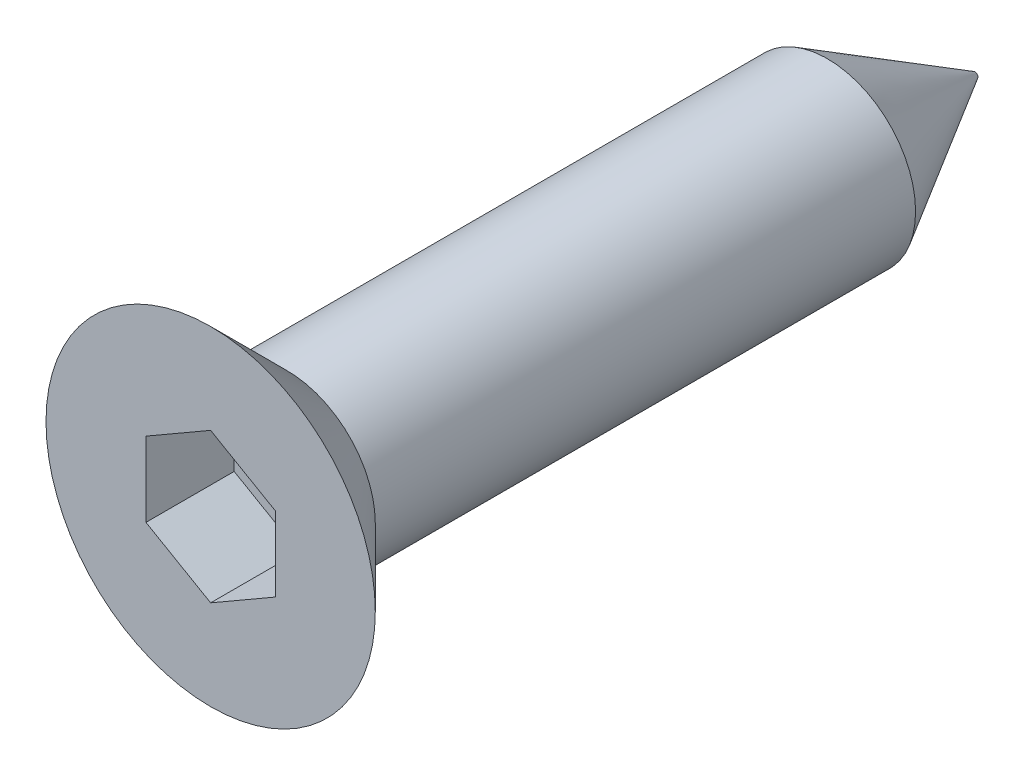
ISO-10303-21;
HEADER;
FILE_DESCRIPTION(('STEP AP214'),'2;1');
FILE_NAME('part.step','',(''),(''),'','','');
FILE_SCHEMA(('AUTOMOTIVE_DESIGN { 1 0 10303 214 1 1 1 1 }'));
ENDSEC;
DATA;
#1=APPLICATION_CONTEXT('core data for automotive mechanical design processes');
#2=APPLICATION_PROTOCOL_DEFINITION('international standard','automotive_design',2000,#1);
#3=PRODUCT_CONTEXT('',#1,'mechanical');
#4=PRODUCT('Part','Part','',(#3));
#5=PRODUCT_RELATED_PRODUCT_CATEGORY('part','',(#4));
#6=PRODUCT_DEFINITION_FORMATION('','',#4);
#7=PRODUCT_DEFINITION_CONTEXT('part definition',#1,'design');
#8=PRODUCT_DEFINITION('design','',#6,#7);
#9=PRODUCT_DEFINITION_SHAPE('','',#8);
#10=(LENGTH_UNIT() NAMED_UNIT(*) SI_UNIT(.MILLI.,.METRE.));
#11=(NAMED_UNIT(*) PLANE_ANGLE_UNIT() SI_UNIT($,.RADIAN.));
#12=(NAMED_UNIT(*) SI_UNIT($,.STERADIAN.) SOLID_ANGLE_UNIT());
#13=UNCERTAINTY_MEASURE_WITH_UNIT(LENGTH_MEASURE(1.E-05),#10,'distance_accuracy_value','');
#14=(GEOMETRIC_REPRESENTATION_CONTEXT(3) GLOBAL_UNCERTAINTY_ASSIGNED_CONTEXT((#13)) GLOBAL_UNIT_ASSIGNED_CONTEXT((#10,
#11,#12)) REPRESENTATION_CONTEXT('',''));
#15=CARTESIAN_POINT('',(0.,0.,0.));
#16=DIRECTION('',(0.,0.,1.));
#17=DIRECTION('',(1.,0.,0.));
#18=AXIS2_PLACEMENT_3D('',#15,#16,#17);
#19=CARTESIAN_POINT('',(0.,2.8,0.));
#20=DIRECTION('',(0.,0.,-1.));
#21=DIRECTION('',(-1.,0.,0.));
#22=AXIS2_PLACEMENT_3D('',#19,#20,#21);
#23=PLANE('',#22);
#24=DIRECTION('',(-0.866025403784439,-0.5,0.));
#25=VECTOR('',#24,1.);
#26=CARTESIAN_POINT('',(0.,1.27017059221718,0.));
#27=LINE('',#26,#25);
#28=CARTESIAN_POINT('',(0.,1.27017059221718,0.));
#29=VERTEX_POINT('',#28);
#30=CARTESIAN_POINT('',(-1.1,0.635085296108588,0.));
#31=VERTEX_POINT('',#30);
#32=EDGE_CURVE('E126',#29,#31,#27,.T.);
#33=ORIENTED_EDGE('',*,*,#32,.F.);
#34=DIRECTION('',(-0.866025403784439,0.5,0.));
#35=VECTOR('',#34,1.);
#36=CARTESIAN_POINT('',(1.1,0.635085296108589,0.));
#37=LINE('',#36,#35);
#38=CARTESIAN_POINT('',(1.1,0.635085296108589,0.));
#39=VERTEX_POINT('',#38);
#40=EDGE_CURVE('E52',#39,#29,#37,.T.);
#41=ORIENTED_EDGE('',*,*,#40,.F.);
#42=DIRECTION('',(0.,1.,0.));
#43=VECTOR('',#42,1.);
#44=CARTESIAN_POINT('',(1.1,-0.635085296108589,0.));
#45=LINE('',#44,#43);
#46=CARTESIAN_POINT('',(1.1,-0.635085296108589,0.));
#47=VERTEX_POINT('',#46);
#48=EDGE_CURVE('E135',#47,#39,#45,.T.);
#49=ORIENTED_EDGE('',*,*,#48,.F.);
#50=DIRECTION('',(0.866025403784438,0.5,0.));
#51=VECTOR('',#50,1.);
#52=CARTESIAN_POINT('',(0.,-1.27017059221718,0.));
#53=LINE('',#52,#51);
#54=CARTESIAN_POINT('',(0.,-1.27017059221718,0.));
#55=VERTEX_POINT('',#54);
#56=EDGE_CURVE('E133',#55,#47,#53,.T.);
#57=ORIENTED_EDGE('',*,*,#56,.F.);
#58=DIRECTION('',(0.866025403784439,-0.5,0.));
#59=VECTOR('',#58,1.);
#60=CARTESIAN_POINT('',(-1.1,-0.635085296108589,0.));
#61=LINE('',#60,#59);
#62=CARTESIAN_POINT('',(-1.1,-0.635085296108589,0.));
#63=VERTEX_POINT('',#62);
#64=EDGE_CURVE('E100',#63,#55,#61,.T.);
#65=ORIENTED_EDGE('',*,*,#64,.F.);
#66=DIRECTION('',(0.,-1.,0.));
#67=VECTOR('',#66,1.);
#68=CARTESIAN_POINT('',(-1.1,0.635085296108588,0.));
#69=LINE('',#68,#67);
#70=EDGE_CURVE('E129',#31,#63,#69,.T.);
#71=ORIENTED_EDGE('',*,*,#70,.F.);
#72=EDGE_LOOP('',(#33,#41,#49,#57,#65,#71));
#73=FACE_BOUND('',#72,.T.);
#74=CARTESIAN_POINT('',(0.,0.,0.));
#75=DIRECTION('',(0.,0.,1.));
#76=DIRECTION('',(1.,0.,0.));
#77=AXIS2_PLACEMENT_3D('',#74,#75,#76);
#78=CIRCLE('',#77,2.8);
#79=CARTESIAN_POINT('',(2.8,0.,0.));
#80=VERTEX_POINT('',#79);
#81=EDGE_CURVE('E147',#80,#80,#78,.T.);
#82=ORIENTED_EDGE('',*,*,#81,.T.);
#83=EDGE_LOOP('',(#82));
#84=FACE_BOUND('',#83,.T.);
#85=ADVANCED_FACE('F37',(#73,#84),#23,.F.);
#86=CARTESIAN_POINT('',(0.,0.,-1.3));
#87=DIRECTION('',(0.,0.,1.));
#88=DIRECTION('',(1.,0.,0.));
#89=AXIS2_PLACEMENT_3D('',#86,#87,#88);
#90=CONICAL_SURFACE('',#89,1.5,0.78539816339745);
#91=ORIENTED_EDGE('',*,*,#81,.F.);
#92=EDGE_LOOP('',(#91));
#93=FACE_BOUND('',#92,.T.);
#94=CARTESIAN_POINT('',(0.,0.,-1.3));
#95=DIRECTION('',(0.,0.,1.));
#96=DIRECTION('',(1.,0.,0.));
#97=AXIS2_PLACEMENT_3D('',#94,#95,#96);
#98=CIRCLE('',#97,1.5);
#99=CARTESIAN_POINT('',(1.5,0.,-1.3));
#100=VERTEX_POINT('',#99);
#101=EDGE_CURVE('E139',#100,#100,#98,.T.);
#102=ORIENTED_EDGE('',*,*,#101,.T.);
#103=EDGE_LOOP('',(#102));
#104=FACE_BOUND('',#103,.T.);
#105=ADVANCED_FACE('F164',(#93,#104),#90,.T.);
#106=CARTESIAN_POINT('',(0.,0.,-13.));
#107=DIRECTION('',(0.,0.,1.));
#108=DIRECTION('',(1.,0.,0.));
#109=AXIS2_PLACEMENT_3D('',#106,#107,#108);
#110=CYLINDRICAL_SURFACE('',#109,1.5);
#111=CARTESIAN_POINT('',(0.,0.,-10.4885263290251));
#112=DIRECTION('',(0.,0.,1.));
#113=DIRECTION('',(1.,0.,0.));
#114=AXIS2_PLACEMENT_3D('',#111,#112,#113);
#115=CIRCLE('',#114,1.5);
#116=CARTESIAN_POINT('',(1.5,0.,-10.4885263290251));
#117=VERTEX_POINT('',#116);
#118=EDGE_CURVE('E45',#117,#117,#115,.T.);
#119=CARTESIAN_POINT('',(1.5,0.,-10.4885263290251));
#120=CARTESIAN_POINT('',(1.5,0.,-10.3928125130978));
#121=CARTESIAN_POINT('',(1.5,0.,-10.2970986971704));
#122=CARTESIAN_POINT('',(1.5,0.,-10.1056710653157));
#123=CARTESIAN_POINT('',(1.5,0.,-10.0099572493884));
#124=CARTESIAN_POINT('',(1.5,0.,-9.81852961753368));
#125=CARTESIAN_POINT('',(1.5,0.,-9.72281580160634));
#126=CARTESIAN_POINT('',(1.5,0.,-9.53138816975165));
#127=CARTESIAN_POINT('',(1.5,0.,-9.4356743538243));
#128=CARTESIAN_POINT('',(1.5,0.,-9.24424672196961));
#129=CARTESIAN_POINT('',(1.5,0.,-9.14853290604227));
#130=CARTESIAN_POINT('',(1.5,0.,-8.95710527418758));
#131=CARTESIAN_POINT('',(1.5,0.,-8.86139145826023));
#132=CARTESIAN_POINT('',(1.5,0.,-8.66996382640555));
#133=CARTESIAN_POINT('',(1.5,0.,-8.5742500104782));
#134=CARTESIAN_POINT('',(1.5,0.,-8.38282237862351));
#135=CARTESIAN_POINT('',(1.5,0.,-8.28710856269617));
#136=CARTESIAN_POINT('',(1.5,0.,-8.09568093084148));
#137=CARTESIAN_POINT('',(1.5,0.,-7.99996711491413));
#138=CARTESIAN_POINT('',(1.5,0.,-7.80853948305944));
#139=CARTESIAN_POINT('',(1.5,0.,-7.7128256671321));
#140=CARTESIAN_POINT('',(1.5,0.,-7.52139803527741));
#141=CARTESIAN_POINT('',(1.5,0.,-7.42568421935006));
#142=CARTESIAN_POINT('',(1.5,0.,-7.23425658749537));
#143=CARTESIAN_POINT('',(1.5,0.,-7.13854277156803));
#144=CARTESIAN_POINT('',(1.5,0.,-6.94711513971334));
#145=CARTESIAN_POINT('',(1.5,0.,-6.85140132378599));
#146=CARTESIAN_POINT('',(1.5,0.,-6.6599736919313));
#147=CARTESIAN_POINT('',(1.5,0.,-6.56425987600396));
#148=CARTESIAN_POINT('',(1.5,0.,-6.37283224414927));
#149=CARTESIAN_POINT('',(1.5,0.,-6.27711842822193));
#150=CARTESIAN_POINT('',(1.5,0.,-6.08569079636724));
#151=CARTESIAN_POINT('',(1.5,0.,-5.98997698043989));
#152=CARTESIAN_POINT('',(1.5,0.,-5.7985493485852));
#153=CARTESIAN_POINT('',(1.5,0.,-5.70283553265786));
#154=CARTESIAN_POINT('',(1.5,0.,-5.51140790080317));
#155=CARTESIAN_POINT('',(1.5,0.,-5.41569408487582));
#156=CARTESIAN_POINT('',(1.5,0.,-5.22426645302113));
#157=CARTESIAN_POINT('',(1.5,0.,-5.12855263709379));
#158=CARTESIAN_POINT('',(1.5,0.,-4.9371250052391));
#159=CARTESIAN_POINT('',(1.5,0.,-4.84141118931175));
#160=CARTESIAN_POINT('',(1.5,0.,-4.64998355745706));
#161=CARTESIAN_POINT('',(1.5,0.,-4.55426974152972));
#162=CARTESIAN_POINT('',(1.5,0.,-4.36284210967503));
#163=CARTESIAN_POINT('',(1.5,0.,-4.26712829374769));
#164=CARTESIAN_POINT('',(1.5,0.,-4.075700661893));
#165=CARTESIAN_POINT('',(1.5,0.,-3.97998684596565));
#166=CARTESIAN_POINT('',(1.5,0.,-3.78855921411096));
#167=CARTESIAN_POINT('',(1.5,0.,-3.69284539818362));
#168=CARTESIAN_POINT('',(1.5,0.,-3.50141776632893));
#169=CARTESIAN_POINT('',(1.5,0.,-3.40570395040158));
#170=CARTESIAN_POINT('',(1.5,0.,-3.21427631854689));
#171=CARTESIAN_POINT('',(1.5,0.,-3.11856250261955));
#172=CARTESIAN_POINT('',(1.5,0.,-2.92713487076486));
#173=CARTESIAN_POINT('',(1.5,0.,-2.83142105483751));
#174=CARTESIAN_POINT('',(1.5,0.,-2.63999342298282));
#175=CARTESIAN_POINT('',(1.5,0.,-2.54427960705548));
#176=CARTESIAN_POINT('',(1.5,0.,-2.35285197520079));
#177=CARTESIAN_POINT('',(1.5,0.,-2.25713815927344));
#178=CARTESIAN_POINT('',(1.5,0.,-2.06571052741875));
#179=CARTESIAN_POINT('',(1.5,0.,-1.96999671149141));
#180=CARTESIAN_POINT('',(1.5,0.,-1.77856907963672));
#181=CARTESIAN_POINT('',(1.5,0.,-1.68285526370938));
#182=CARTESIAN_POINT('',(1.5,0.,-1.49142763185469));
#183=CARTESIAN_POINT('',(1.5,0.,-1.39571381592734));
#184=CARTESIAN_POINT('',(1.5,0.,-1.3));
#185=B_SPLINE_CURVE_WITH_KNOTS('',3,(#119,#120,#121,#122,#123,#124,#125,#126,#127,#128,#129,
#130,#131,#132,#133,#134,#135,#136,#137,#138,#139,#140,#141,#142,#143,#144,#145,#146,#147,#148,
#149,#150,#151,#152,#153,#154,#155,#156,#157,#158,#159,#160,#161,#162,#163,#164,#165,#166,#167,
#168,#169,#170,#171,#172,#173,#174,#175,#176,#177,#178,#179,#180,#181,#182,#183,#184),
.UNSPECIFIED.,.F.,.F.,(4,2,2,2,2,2,2,2,2,2,2,2,2,2,2,2,2,2,2,2,2,2,2,2,2,2,2,2,2,2,2,2,4),(0.,
0.287141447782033,0.574282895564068,0.861424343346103,1.14856579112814,1.43570723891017,
1.72284868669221,2.00999013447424,2.29713158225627,2.58427303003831,2.87141447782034,
3.15855592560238,3.44569737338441,3.73283882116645,4.01998026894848,4.30712171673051,
4.59426316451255,4.88140461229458,5.16854606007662,5.45568750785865,5.74282895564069,
6.02997040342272,6.31711185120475,6.60425329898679,6.89139474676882,7.17853619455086,
7.46567764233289,7.75281909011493,8.03996053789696,8.327101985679,8.61424343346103,
8.90138488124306,9.1885263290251),.UNSPECIFIED.);
#186=EDGE_CURVE('BSEAM152',#117,#100,#185,.T.);
#187=ORIENTED_EDGE('',*,*,#118,.T.);
#188=ORIENTED_EDGE('',*,*,#101,.F.);
#189=ORIENTED_EDGE('',*,*,#186,.T.);
#190=ORIENTED_EDGE('',*,*,#186,.F.);
#191=EDGE_LOOP('',(#187,#189,#188,#190));
#192=FACE_BOUND('',#191,.T.);
#193=ADVANCED_FACE('F152',(#192),#110,.T.);
#194=CARTESIAN_POINT('',(0.,0.,-13.));
#195=DIRECTION('',(0.,0.,1.));
#196=DIRECTION('',(1.,0.,0.));
#197=AXIS2_PLACEMENT_3D('',#194,#195,#196);
#198=PLANE('',#197);
#199=CARTESIAN_POINT('',(0.,0.,-13.));
#200=DIRECTION('',(0.,0.,1.));
#201=DIRECTION('',(1.,0.,0.));
#202=AXIS2_PLACEMENT_3D('',#199,#200,#201);
#203=CIRCLE('',#202,0.0499999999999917);
#204=CARTESIAN_POINT('',(0.0499999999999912,0.,-13.));
#205=VERTEX_POINT('',#204);
#206=EDGE_CURVE('E11',#205,#205,#203,.F.);
#207=ORIENTED_EDGE('',*,*,#206,.T.);
#208=EDGE_LOOP('',(#207));
#209=FACE_BOUND('',#208,.T.);
#210=ADVANCED_FACE('F176',(#209),#198,.F.);
#211=CARTESIAN_POINT('',(1.1,0.635085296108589,-1.5));
#212=DIRECTION('',(0.5,0.866025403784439,0.));
#213=DIRECTION('',(-0.866025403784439,0.5,0.));
#214=AXIS2_PLACEMENT_3D('',#211,#212,#213);
#215=PLANE('',#214);
#216=ORIENTED_EDGE('',*,*,#40,.T.);
#217=DIRECTION('',(0.,0.,1.));
#218=VECTOR('',#217,1.);
#219=CARTESIAN_POINT('',(0.,1.27017059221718,-1.5));
#220=LINE('',#219,#218);
#221=CARTESIAN_POINT('',(0.,1.27017059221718,-1.5));
#222=VERTEX_POINT('',#221);
#223=EDGE_CURVE('E82',#222,#29,#220,.T.);
#224=ORIENTED_EDGE('',*,*,#223,.F.);
#225=DIRECTION('',(-0.866025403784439,0.5,0.));
#226=VECTOR('',#225,1.);
#227=CARTESIAN_POINT('',(1.1,0.635085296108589,-1.5));
#228=LINE('',#227,#226);
#229=CARTESIAN_POINT('',(1.1,0.635085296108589,-1.5));
#230=VERTEX_POINT('',#229);
#231=EDGE_CURVE('E137',#230,#222,#228,.T.);
#232=ORIENTED_EDGE('',*,*,#231,.F.);
#233=DIRECTION('',(0.,0.,1.));
#234=VECTOR('',#233,1.);
#235=CARTESIAN_POINT('',(1.1,0.635085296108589,-1.5));
#236=LINE('',#235,#234);
#237=EDGE_CURVE('E60',#230,#39,#236,.T.);
#238=ORIENTED_EDGE('',*,*,#237,.T.);
#239=EDGE_LOOP('',(#216,#224,#232,#238));
#240=FACE_BOUND('',#239,.T.);
#241=ADVANCED_FACE('F179',(#240),#215,.F.);
#242=CARTESIAN_POINT('',(1.1,-0.635085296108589,-1.5));
#243=DIRECTION('',(1.,0.,0.));
#244=DIRECTION('',(0.,1.,0.));
#245=AXIS2_PLACEMENT_3D('',#242,#243,#244);
#246=PLANE('',#245);
#247=ORIENTED_EDGE('',*,*,#48,.T.);
#248=ORIENTED_EDGE('',*,*,#237,.F.);
#249=DIRECTION('',(0.,1.,0.));
#250=VECTOR('',#249,1.);
#251=CARTESIAN_POINT('',(1.1,-0.635085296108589,-1.5));
#252=LINE('',#251,#250);
#253=CARTESIAN_POINT('',(1.1,-0.635085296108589,-1.5));
#254=VERTEX_POINT('',#253);
#255=EDGE_CURVE('E112',#254,#230,#252,.T.);
#256=ORIENTED_EDGE('',*,*,#255,.F.);
#257=DIRECTION('',(0.,0.,1.));
#258=VECTOR('',#257,1.);
#259=CARTESIAN_POINT('',(1.1,-0.635085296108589,-1.5));
#260=LINE('',#259,#258);
#261=EDGE_CURVE('E104',#254,#47,#260,.T.);
#262=ORIENTED_EDGE('',*,*,#261,.T.);
#263=EDGE_LOOP('',(#247,#248,#256,#262));
#264=FACE_BOUND('',#263,.T.);
#265=ADVANCED_FACE('F183',(#264),#246,.F.);
#266=CARTESIAN_POINT('',(0.,-1.27017059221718,-1.5));
#267=DIRECTION('',(0.5,-0.866025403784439,0.));
#268=DIRECTION('',(0.866025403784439,0.5,0.));
#269=AXIS2_PLACEMENT_3D('',#266,#267,#268);
#270=PLANE('',#269);
#271=ORIENTED_EDGE('',*,*,#56,.T.);
#272=ORIENTED_EDGE('',*,*,#261,.F.);
#273=DIRECTION('',(0.866025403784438,0.5,0.));
#274=VECTOR('',#273,1.);
#275=CARTESIAN_POINT('',(0.,-1.27017059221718,-1.5));
#276=LINE('',#275,#274);
#277=CARTESIAN_POINT('',(0.,-1.27017059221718,-1.5));
#278=VERTEX_POINT('',#277);
#279=EDGE_CURVE('E108',#278,#254,#276,.T.);
#280=ORIENTED_EDGE('',*,*,#279,.F.);
#281=DIRECTION('',(0.,0.,1.));
#282=VECTOR('',#281,1.);
#283=CARTESIAN_POINT('',(0.,-1.27017059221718,-1.5));
#284=LINE('',#283,#282);
#285=EDGE_CURVE('E93',#278,#55,#284,.T.);
#286=ORIENTED_EDGE('',*,*,#285,.T.);
#287=EDGE_LOOP('',(#271,#272,#280,#286));
#288=FACE_BOUND('',#287,.T.);
#289=ADVANCED_FACE('F109',(#288),#270,.F.);
#290=CARTESIAN_POINT('',(-1.1,-0.635085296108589,-1.5));
#291=DIRECTION('',(-0.5,-0.866025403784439,0.));
#292=DIRECTION('',(0.866025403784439,-0.5,0.));
#293=AXIS2_PLACEMENT_3D('',#290,#291,#292);
#294=PLANE('',#293);
#295=ORIENTED_EDGE('',*,*,#64,.T.);
#296=ORIENTED_EDGE('',*,*,#285,.F.);
#297=DIRECTION('',(0.866025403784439,-0.5,0.));
#298=VECTOR('',#297,1.);
#299=CARTESIAN_POINT('',(-1.1,-0.635085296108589,-1.5));
#300=LINE('',#299,#298);
#301=CARTESIAN_POINT('',(-1.1,-0.635085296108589,-1.5));
#302=VERTEX_POINT('',#301);
#303=EDGE_CURVE('E97',#302,#278,#300,.T.);
#304=ORIENTED_EDGE('',*,*,#303,.F.);
#305=DIRECTION('',(0.,0.,1.));
#306=VECTOR('',#305,1.);
#307=CARTESIAN_POINT('',(-1.1,-0.635085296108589,-1.5));
#308=LINE('',#307,#306);
#309=EDGE_CURVE('E105',#302,#63,#308,.T.);
#310=ORIENTED_EDGE('',*,*,#309,.T.);
#311=EDGE_LOOP('',(#295,#296,#304,#310));
#312=FACE_BOUND('',#311,.T.);
#313=ADVANCED_FACE('F95',(#312),#294,.F.);
#314=CARTESIAN_POINT('',(-1.1,0.635085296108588,-1.5));
#315=DIRECTION('',(-1.,0.,0.));
#316=DIRECTION('',(0.,-1.,0.));
#317=AXIS2_PLACEMENT_3D('',#314,#315,#316);
#318=PLANE('',#317);
#319=ORIENTED_EDGE('',*,*,#70,.T.);
#320=ORIENTED_EDGE('',*,*,#309,.F.);
#321=DIRECTION('',(0.,-1.,0.));
#322=VECTOR('',#321,1.);
#323=CARTESIAN_POINT('',(-1.1,0.635085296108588,-1.5));
#324=LINE('',#323,#322);
#325=CARTESIAN_POINT('',(-1.1,0.635085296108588,-1.5));
#326=VERTEX_POINT('',#325);
#327=EDGE_CURVE('E118',#326,#302,#324,.T.);
#328=ORIENTED_EDGE('',*,*,#327,.F.);
#329=DIRECTION('',(0.,0.,1.));
#330=VECTOR('',#329,1.);
#331=CARTESIAN_POINT('',(-1.1,0.635085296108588,-1.5));
#332=LINE('',#331,#330);
#333=EDGE_CURVE('E142',#326,#31,#332,.T.);
#334=ORIENTED_EDGE('',*,*,#333,.T.);
#335=EDGE_LOOP('',(#319,#320,#328,#334));
#336=FACE_BOUND('',#335,.T.);
#337=ADVANCED_FACE('F186',(#336),#318,.F.);
#338=CARTESIAN_POINT('',(0.,1.27017059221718,-1.5));
#339=DIRECTION('',(-0.5,0.866025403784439,0.));
#340=DIRECTION('',(-0.866025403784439,-0.5,0.));
#341=AXIS2_PLACEMENT_3D('',#338,#339,#340);
#342=PLANE('',#341);
#343=ORIENTED_EDGE('',*,*,#32,.T.);
#344=ORIENTED_EDGE('',*,*,#333,.F.);
#345=DIRECTION('',(-0.866025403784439,-0.5,0.));
#346=VECTOR('',#345,1.);
#347=CARTESIAN_POINT('',(0.,1.27017059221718,-1.5));
#348=LINE('',#347,#346);
#349=EDGE_CURVE('E120',#222,#326,#348,.T.);
#350=ORIENTED_EDGE('',*,*,#349,.F.);
#351=ORIENTED_EDGE('',*,*,#223,.T.);
#352=EDGE_LOOP('',(#343,#344,#350,#351));
#353=FACE_BOUND('',#352,.T.);
#354=ADVANCED_FACE('F160',(#353),#342,.F.);
#355=CARTESIAN_POINT('',(-1.1,1.90525588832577,-1.5));
#356=DIRECTION('',(0.,0.,1.));
#357=DIRECTION('',(1.,0.,0.));
#358=AXIS2_PLACEMENT_3D('',#355,#356,#357);
#359=PLANE('',#358);
#360=ORIENTED_EDGE('',*,*,#231,.T.);
#361=ORIENTED_EDGE('',*,*,#349,.T.);
#362=ORIENTED_EDGE('',*,*,#327,.T.);
#363=ORIENTED_EDGE('',*,*,#303,.T.);
#364=ORIENTED_EDGE('',*,*,#279,.T.);
#365=ORIENTED_EDGE('',*,*,#255,.T.);
#366=EDGE_LOOP('',(#360,#361,#362,#363,#364,#365));
#367=FACE_BOUND('',#366,.T.);
#368=ADVANCED_FACE('F115',(#367),#359,.T.);
#369=CARTESIAN_POINT('',(0.,0.,-10.4885263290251));
#370=DIRECTION('',(0.,0.,1.));
#371=DIRECTION('',(1.,0.,0.));
#372=AXIS2_PLACEMENT_3D('',#369,#370,#371);
#373=CONICAL_SURFACE('',#372,1.5,0.523598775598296);
#374=CARTESIAN_POINT('',(0.0499999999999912,0.,-13.));
#375=CARTESIAN_POINT('',(0.0651041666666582,0.,-12.9738388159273));
#376=CARTESIAN_POINT('',(0.0802083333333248,0.,-12.9476776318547));
#377=CARTESIAN_POINT('',(0.110416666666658,0.,-12.8953552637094));
#378=CARTESIAN_POINT('',(0.125520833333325,0.,-12.8691940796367));
#379=CARTESIAN_POINT('',(0.155729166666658,0.,-12.8168717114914));
#380=CARTESIAN_POINT('',(0.170833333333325,0.,-12.7907105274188));
#381=CARTESIAN_POINT('',(0.201041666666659,0.,-12.7383881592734));
#382=CARTESIAN_POINT('',(0.216145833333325,0.,-12.7122269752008));
#383=CARTESIAN_POINT('',(0.246354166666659,0.,-12.6599046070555));
#384=CARTESIAN_POINT('',(0.261458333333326,0.,-12.6337434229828));
#385=CARTESIAN_POINT('',(0.291666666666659,0.,-12.5814210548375));
#386=CARTESIAN_POINT('',(0.306770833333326,0.,-12.5552598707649));
#387=CARTESIAN_POINT('',(0.33697916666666,0.,-12.5029375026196));
#388=CARTESIAN_POINT('',(0.352083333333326,0.,-12.4767763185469));
#389=CARTESIAN_POINT('',(0.38229166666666,0.,-12.4244539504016));
#390=CARTESIAN_POINT('',(0.397395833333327,0.,-12.3982927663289));
#391=CARTESIAN_POINT('',(0.42760416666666,0.,-12.3459703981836));
#392=CARTESIAN_POINT('',(0.442708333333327,0.,-12.319809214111));
#393=CARTESIAN_POINT('',(0.47291666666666,0.,-12.2674868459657));
#394=CARTESIAN_POINT('',(0.488020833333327,0.,-12.241325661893));
#395=CARTESIAN_POINT('',(0.518229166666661,0.,-12.1890032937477));
#396=CARTESIAN_POINT('',(0.533333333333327,0.,-12.162842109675));
#397=CARTESIAN_POINT('',(0.563541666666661,0.,-12.1105197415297));
#398=CARTESIAN_POINT('',(0.578645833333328,0.,-12.0843585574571));
#399=CARTESIAN_POINT('',(0.608854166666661,0.,-12.0320361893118));
#400=CARTESIAN_POINT('',(0.623958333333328,0.,-12.0058750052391));
#401=CARTESIAN_POINT('',(0.654166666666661,0.,-11.9535526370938));
#402=CARTESIAN_POINT('',(0.669270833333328,0.,-11.9273914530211));
#403=CARTESIAN_POINT('',(0.699479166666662,0.,-11.8750690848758));
#404=CARTESIAN_POINT('',(0.714583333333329,0.,-11.8489079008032));
#405=CARTESIAN_POINT('',(0.744791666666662,0.,-11.7965855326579));
#406=CARTESIAN_POINT('',(0.759895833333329,0.,-11.7704243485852));
#407=CARTESIAN_POINT('',(0.790104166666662,0.,-11.7181019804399));
#408=CARTESIAN_POINT('',(0.805208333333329,0.,-11.6919407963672));
#409=CARTESIAN_POINT('',(0.835416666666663,0.,-11.6396184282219));
#410=CARTESIAN_POINT('',(0.850520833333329,0.,-11.6134572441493));
#411=CARTESIAN_POINT('',(0.880729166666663,0.,-11.561134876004));
#412=CARTESIAN_POINT('',(0.89583333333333,0.,-11.5349736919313));
#413=CARTESIAN_POINT('',(0.926041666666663,0.,-11.482651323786));
#414=CARTESIAN_POINT('',(0.94114583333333,0.,-11.4564901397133));
#415=CARTESIAN_POINT('',(0.971354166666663,0.,-11.404167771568));
#416=CARTESIAN_POINT('',(0.98645833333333,0.,-11.3780065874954));
#417=CARTESIAN_POINT('',(1.01666666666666,0.,-11.3256842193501));
#418=CARTESIAN_POINT('',(1.03177083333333,0.,-11.2995230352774));
#419=CARTESIAN_POINT('',(1.06197916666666,0.,-11.2472006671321));
#420=CARTESIAN_POINT('',(1.07708333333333,0.,-11.2210394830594));
#421=CARTESIAN_POINT('',(1.10729166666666,0.,-11.1687171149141));
#422=CARTESIAN_POINT('',(1.12239583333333,0.,-11.1425559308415));
#423=CARTESIAN_POINT('',(1.15260416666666,0.,-11.0902335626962));
#424=CARTESIAN_POINT('',(1.16770833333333,0.,-11.0640723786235));
#425=CARTESIAN_POINT('',(1.19791666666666,0.,-11.0117500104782));
#426=CARTESIAN_POINT('',(1.21302083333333,0.,-10.9855888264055));
#427=CARTESIAN_POINT('',(1.24322916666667,0.,-10.9332664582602));
#428=CARTESIAN_POINT('',(1.25833333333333,0.,-10.9071052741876));
#429=CARTESIAN_POINT('',(1.28854166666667,0.,-10.8547829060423));
#430=CARTESIAN_POINT('',(1.30364583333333,0.,-10.8286217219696));
#431=CARTESIAN_POINT('',(1.33385416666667,0.,-10.7762993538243));
#432=CARTESIAN_POINT('',(1.34895833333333,0.,-10.7501381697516));
#433=CARTESIAN_POINT('',(1.37916666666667,0.,-10.6978158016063));
#434=CARTESIAN_POINT('',(1.39427083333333,0.,-10.6716546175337));
#435=CARTESIAN_POINT('',(1.42447916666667,0.,-10.6193322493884));
#436=CARTESIAN_POINT('',(1.43958333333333,0.,-10.5931710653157));
#437=CARTESIAN_POINT('',(1.46979166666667,0.,-10.5408486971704));
#438=CARTESIAN_POINT('',(1.48489583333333,0.,-10.5146875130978));
#439=CARTESIAN_POINT('',(1.5,0.,-10.4885263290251));
#440=B_SPLINE_CURVE_WITH_KNOTS('',3,(#374,#375,#376,#377,#378,#379,#380,#381,#382,#383,#384,
#385,#386,#387,#388,#389,#390,#391,#392,#393,#394,#395,#396,#397,#398,#399,#400,#401,#402,#403,
#404,#405,#406,#407,#408,#409,#410,#411,#412,#413,#414,#415,#416,#417,#418,#419,#420,#421,#422,
#423,#424,#425,#426,#427,#428,#429,#430,#431,#432,#433,#434,#435,#436,#437,#438,#439),
.UNSPECIFIED.,.F.,.F.,(4,2,2,2,2,2,2,2,2,2,2,2,2,2,2,2,2,2,2,2,2,2,2,2,2,2,2,2,2,2,2,2,4),(0.,
0.0906250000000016,0.181250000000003,0.271875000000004,0.362500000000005,0.453125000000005,
0.543750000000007,0.634375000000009,0.725000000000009,0.815625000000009,0.906250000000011,
0.996875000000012,1.08750000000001,1.17812500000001,1.26875000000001,1.35937500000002,
1.45000000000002,1.54062500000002,1.63125000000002,1.72187500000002,1.81250000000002,
1.90312500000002,1.99375000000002,2.08437500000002,2.17500000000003,2.26562500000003,
2.35625000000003,2.44687500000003,2.53750000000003,2.62812500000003,2.71875000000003,
2.80937500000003,2.90000000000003),.UNSPECIFIED.);
#441=EDGE_CURVE('BSEAM39',#205,#117,#440,.T.);
#442=ORIENTED_EDGE('',*,*,#206,.F.);
#443=ORIENTED_EDGE('',*,*,#118,.F.);
#444=ORIENTED_EDGE('',*,*,#441,.T.);
#445=ORIENTED_EDGE('',*,*,#441,.F.);
#446=EDGE_LOOP('',(#442,#444,#443,#445));
#447=FACE_BOUND('',#446,.T.);
#448=ADVANCED_FACE('F39',(#447),#373,.T.);
#449=CLOSED_SHELL('',(#85,#105,#193,#210,#241,#265,#289,#313,#337,#354,#368,#448));
#450=MANIFOLD_SOLID_BREP('B2',#449);
#451=ADVANCED_BREP_SHAPE_REPRESENTATION('',(#18,#450),#14);
#452=SHAPE_DEFINITION_REPRESENTATION(#9,#451);
ENDSEC;
END-ISO-10303-21;
